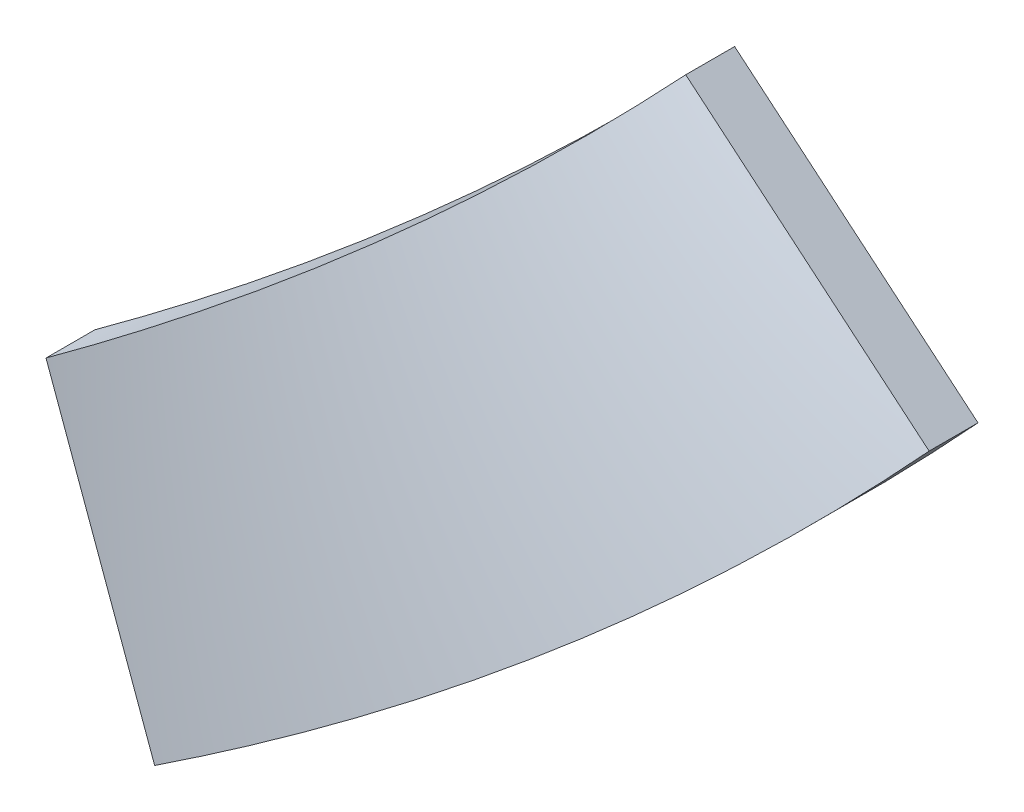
ISO-10303-21;
HEADER;
FILE_DESCRIPTION(('STEP AP214'),'2;1');
FILE_NAME('part.step','',(''),(''),'','','');
FILE_SCHEMA(('AUTOMOTIVE_DESIGN { 1 0 10303 214 1 1 1 1 }'));
ENDSEC;
DATA;
#1=APPLICATION_CONTEXT('core data for automotive mechanical design processes');
#2=APPLICATION_PROTOCOL_DEFINITION('international standard','automotive_design',2000,#1);
#3=PRODUCT_CONTEXT('',#1,'mechanical');
#4=PRODUCT('Part','Part','',(#3));
#5=PRODUCT_RELATED_PRODUCT_CATEGORY('part','',(#4));
#6=PRODUCT_DEFINITION_FORMATION('','',#4);
#7=PRODUCT_DEFINITION_CONTEXT('part definition',#1,'design');
#8=PRODUCT_DEFINITION('design','',#6,#7);
#9=PRODUCT_DEFINITION_SHAPE('','',#8);
#10=(LENGTH_UNIT() NAMED_UNIT(*) SI_UNIT(.MILLI.,.METRE.));
#11=(NAMED_UNIT(*) PLANE_ANGLE_UNIT() SI_UNIT($,.RADIAN.));
#12=(NAMED_UNIT(*) SI_UNIT($,.STERADIAN.) SOLID_ANGLE_UNIT());
#13=UNCERTAINTY_MEASURE_WITH_UNIT(LENGTH_MEASURE(1.E-05),#10,'distance_accuracy_value','');
#14=(GEOMETRIC_REPRESENTATION_CONTEXT(3) GLOBAL_UNCERTAINTY_ASSIGNED_CONTEXT((#13)) GLOBAL_UNIT_ASSIGNED_CONTEXT((#10,
#11,#12)) REPRESENTATION_CONTEXT('',''));
#15=CARTESIAN_POINT('',(0.,0.,0.));
#16=DIRECTION('',(0.,0.,1.));
#17=DIRECTION('',(1.,0.,0.));
#18=AXIS2_PLACEMENT_3D('',#15,#16,#17);
#19=CARTESIAN_POINT('',(9.19253331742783,-7.71345131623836,2.));
#20=CARTESIAN_POINT('',(8.4777767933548,-8.56526497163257,3.41176470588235));
#21=CARTESIAN_POINT('',(7.61867000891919,-9.27123871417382,4.82352941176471));
#22=CARTESIAN_POINT('',(6.75956322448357,-9.97721245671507,6.23529411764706));
#23=CARTESIAN_POINT('',(5.78536203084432,-10.5133051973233,7.64705882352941));
#24=CARTESIAN_POINT('',(4.97439515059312,-10.9595718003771,8.82227234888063));
#25=CARTESIAN_POINT('',(4.10458165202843,-11.2761877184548,10.0002842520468));
#26=CARTESIAN_POINT('',(4.07507070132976,-11.2869298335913,10.0402517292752));
#27=CARTESIAN_POINT('',(4.04555975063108,-11.2976719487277,10.0802192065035));
#28=CARTESIAN_POINT('',(14.1718221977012,-11.8915707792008,2.));
#29=CARTESIAN_POINT('',(13.0699058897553,-13.2047834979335,3.41176470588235));
#30=CARTESIAN_POINT('',(11.7454495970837,-14.2931596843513,4.82352941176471));
#31=CARTESIAN_POINT('',(10.4209933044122,-15.3815358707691,6.23529411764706));
#32=CARTESIAN_POINT('',(8.91909979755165,-16.2080121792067,7.64705882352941));
#33=CARTESIAN_POINT('',(7.66885919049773,-16.8960065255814,8.82227234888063));
#34=CARTESIAN_POINT('',(6.32789671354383,-17.3841227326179,10.0002842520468));
#35=CARTESIAN_POINT('',(6.28240066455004,-17.4006834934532,10.0402517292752));
#36=CARTESIAN_POINT('',(6.23690461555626,-17.4172442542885,10.0802192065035));
#37=(BOUNDED_SURFACE() B_SPLINE_SURFACE(1,2,((#19,#20,#21,#22,#23,#24,#25,#26,#27),(#28,#29,#30,
#31,#32,#33,#34,#35,#36)),.UNSPECIFIED.,.F.,.F.,.F.) B_SPLINE_SURFACE_WITH_KNOTS((2,2),(3,2,2,2,
3),(0.,1.),(0.,0.0294117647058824,0.0588235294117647,0.0833246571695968,0.0841579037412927),
.UNSPECIFIED.) GEOMETRIC_REPRESENTATION_ITEM() RATIONAL_B_SPLINE_SURFACE(((1.,0.995734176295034,
1.,0.995734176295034,1.,0.996446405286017,0.99881337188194,0.99881337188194,0.99881337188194),
(1.,0.995734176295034,1.,0.995734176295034,1.,0.996446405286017,0.99881337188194,
0.99881337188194,0.99881337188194))) REPRESENTATION_ITEM('') SURFACE());
#38=CARTESIAN_POINT('',(9.19253331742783,-7.71345131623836,2.));
#39=CARTESIAN_POINT('',(8.4777767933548,-8.56526497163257,3.41176470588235));
#40=CARTESIAN_POINT('',(7.61867000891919,-9.27123871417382,4.82352941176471));
#41=CARTESIAN_POINT('',(6.75956322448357,-9.97721245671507,6.23529411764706));
#42=CARTESIAN_POINT('',(5.78536203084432,-10.5133051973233,7.64705882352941));
#43=CARTESIAN_POINT('',(4.97439515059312,-10.9595718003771,8.82227234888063));
#44=CARTESIAN_POINT('',(4.10458165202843,-11.2761877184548,10.0002842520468));
#45=CARTESIAN_POINT('',(4.07507070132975,-11.2869298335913,10.0402517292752));
#46=CARTESIAN_POINT('',(4.04555975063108,-11.2976719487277,10.0802192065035));
#47=(BOUNDED_CURVE() B_SPLINE_CURVE(2,(#38,#39,#40,#41,#42,#43,#44,#45,#46),.UNSPECIFIED.,.F.,
.F.) B_SPLINE_CURVE_WITH_KNOTS((3,2,2,2,3),(0.,0.0294117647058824,0.0588235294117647,
0.0833246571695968,0.0841579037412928),
.UNSPECIFIED.) CURVE() GEOMETRIC_REPRESENTATION_ITEM() RATIONAL_B_SPLINE_CURVE((1.,
0.995734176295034,1.,0.995734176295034,1.,0.996446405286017,0.99881337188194,0.99881337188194,0.99881337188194)) REPRESENTATION_ITEM(''));
#48=CARTESIAN_POINT('',(9.19253331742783,-7.71345131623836,2.));
#49=VERTEX_POINT('',#48);
#50=CARTESIAN_POINT('',(4.10452309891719,-11.2762090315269,10.0002842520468));
#51=VERTEX_POINT('',#50);
#52=EDGE_CURVE('E131',#49,#51,#47,.T.);
#53=CARTESIAN_POINT('',(4.10446454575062,-11.276230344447,10.0004428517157));
#54=CARTESIAN_POINT('',(4.29052923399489,-11.7874074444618,10.0004428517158));
#55=CARTESIAN_POINT('',(4.47659392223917,-12.2985845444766,10.0004428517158));
#56=CARTESIAN_POINT('',(4.84872329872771,-13.3209387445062,10.0004428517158));
#57=CARTESIAN_POINT('',(5.03478798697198,-13.8321158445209,10.0004428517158));
#58=CARTESIAN_POINT('',(5.58980717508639,-15.3569247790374,10.0004428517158));
#59=CARTESIAN_POINT('',(5.95876167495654,-16.3705566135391,10.0004428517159));
#60=CARTESIAN_POINT('',(6.32771617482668,-17.3841884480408,10.0004428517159));
#61=B_SPLINE_CURVE_WITH_KNOTS('',3,(#53,#54,#55,#56,#57,#58,#59,#60),.UNSPECIFIED.,.F.,.F.,(4,2,
2,4),(0.,1.63196166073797,3.26392332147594,6.50000000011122),.UNSPECIFIED.);
#62=CARTESIAN_POINT('',(6.32776130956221,-17.3841720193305,10.0003635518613));
#63=VERTEX_POINT('',#62);
#64=EDGE_CURVE('E61',#51,#63,#61,.T.);
#65=CARTESIAN_POINT('',(14.1718221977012,-11.8915707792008,2.));
#66=CARTESIAN_POINT('',(13.0699058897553,-13.2047834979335,3.41176470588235));
#67=CARTESIAN_POINT('',(11.7454495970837,-14.2931596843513,4.82352941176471));
#68=CARTESIAN_POINT('',(10.4209933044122,-15.3815358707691,6.23529411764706));
#69=CARTESIAN_POINT('',(8.91909979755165,-16.2080121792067,7.64705882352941));
#70=CARTESIAN_POINT('',(7.66885919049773,-16.8960065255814,8.82227234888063));
#71=CARTESIAN_POINT('',(6.32789671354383,-17.3841227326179,10.0002842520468));
#72=CARTESIAN_POINT('',(6.28240066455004,-17.4006834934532,10.0402517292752));
#73=CARTESIAN_POINT('',(6.23690461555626,-17.4172442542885,10.0802192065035));
#74=(BOUNDED_CURVE() B_SPLINE_CURVE(2,(#65,#66,#67,#68,#69,#70,#71,#72,#73),.UNSPECIFIED.,.F.,
.F.) B_SPLINE_CURVE_WITH_KNOTS((3,2,2,2,3),(0.,0.0294117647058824,0.0588235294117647,
0.0833246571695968,0.0841579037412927),
.UNSPECIFIED.) CURVE() GEOMETRIC_REPRESENTATION_ITEM() RATIONAL_B_SPLINE_CURVE((1.,
0.995734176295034,1.,0.995734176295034,1.,0.996446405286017,0.99881337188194,0.99881337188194,0.99881337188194)) REPRESENTATION_ITEM(''));
#75=CARTESIAN_POINT('',(14.1718221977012,-11.8915707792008,2.));
#76=VERTEX_POINT('',#75);
#77=EDGE_CURVE('E58',#63,#76,#74,.F.);
#78=DIRECTION('',(-0.766044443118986,0.64278760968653,0.));
#79=VECTOR('',#78,1.);
#80=CARTESIAN_POINT('',(14.1718221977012,-11.8915707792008,2.));
#81=LINE('',#80,#79);
#82=EDGE_CURVE('E59',#49,#76,#81,.F.);
#83=ORIENTED_EDGE('',*,*,#52,.T.);
#84=ORIENTED_EDGE('',*,*,#64,.T.);
#85=ORIENTED_EDGE('',*,*,#77,.T.);
#86=ORIENTED_EDGE('',*,*,#82,.F.);
#87=EDGE_LOOP('',(#83,#84,#85,#86));
#88=FACE_BOUND('',#87,.T.);
#89=ADVANCED_FACE('F17',(#88),#37,.F.);
#90=CARTESIAN_POINT('',(9.19253331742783,-7.71345131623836,1.));
#91=CARTESIAN_POINT('',(8.4777767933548,-8.56526497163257,2.41176470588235));
#92=CARTESIAN_POINT('',(7.61867000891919,-9.27123871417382,3.82352941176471));
#93=CARTESIAN_POINT('',(6.75956322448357,-9.97721245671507,5.23529411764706));
#94=CARTESIAN_POINT('',(5.78536203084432,-10.5133051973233,6.64705882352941));
#95=CARTESIAN_POINT('',(4.97439515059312,-10.9595718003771,7.82227234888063));
#96=CARTESIAN_POINT('',(4.10458165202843,-11.2761877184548,9.00028425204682));
#97=CARTESIAN_POINT('',(4.07507070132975,-11.2869298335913,9.04025172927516));
#98=CARTESIAN_POINT('',(4.04555975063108,-11.2976719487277,9.08021920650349));
#99=CARTESIAN_POINT('',(9.19253331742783,-7.71345131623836,2.));
#100=CARTESIAN_POINT('',(8.4777767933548,-8.56526497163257,3.41176470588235));
#101=CARTESIAN_POINT('',(7.61867000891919,-9.27123871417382,4.82352941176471));
#102=CARTESIAN_POINT('',(6.75956322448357,-9.97721245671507,6.23529411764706));
#103=CARTESIAN_POINT('',(5.78536203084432,-10.5133051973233,7.64705882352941));
#104=CARTESIAN_POINT('',(4.97439515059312,-10.9595718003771,8.82227234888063));
#105=CARTESIAN_POINT('',(4.10458165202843,-11.2761877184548,10.0002842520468));
#106=CARTESIAN_POINT('',(4.07507070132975,-11.2869298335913,10.0402517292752));
#107=CARTESIAN_POINT('',(4.04555975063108,-11.2976719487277,10.0802192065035));
#108=(BOUNDED_SURFACE() B_SPLINE_SURFACE(1,2,((#90,#91,#92,#93,#94,#95,#96,#97,#98),(#99,#100,
#101,#102,#103,#104,#105,#106,#107)),.UNSPECIFIED.,.F.,.F.,.F.) B_SPLINE_SURFACE_WITH_KNOTS((2,
2),(3,2,2,2,3),(0.,1.),(0.,0.0294117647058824,0.0588235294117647,0.0833246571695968,
0.0841579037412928),
.UNSPECIFIED.) GEOMETRIC_REPRESENTATION_ITEM() RATIONAL_B_SPLINE_SURFACE(((1.,0.995734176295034,
1.,0.995734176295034,1.,0.996446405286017,0.99881337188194,0.99881337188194,0.99881337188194),
(1.,0.995734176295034,1.,0.995734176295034,1.,0.996446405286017,0.99881337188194,
0.99881337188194,0.99881337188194))) REPRESENTATION_ITEM('') SURFACE());
#109=CARTESIAN_POINT('',(9.19253331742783,-7.71345131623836,1.));
#110=CARTESIAN_POINT('',(8.4777767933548,-8.56526497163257,2.41176470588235));
#111=CARTESIAN_POINT('',(7.61867000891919,-9.27123871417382,3.82352941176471));
#112=CARTESIAN_POINT('',(6.75956322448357,-9.97721245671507,5.23529411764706));
#113=CARTESIAN_POINT('',(5.78536203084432,-10.5133051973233,6.64705882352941));
#114=CARTESIAN_POINT('',(4.97439515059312,-10.9595718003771,7.82227234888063));
#115=CARTESIAN_POINT('',(4.10458165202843,-11.2761877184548,9.00028425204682));
#116=CARTESIAN_POINT('',(4.07507070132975,-11.2869298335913,9.04025172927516));
#117=CARTESIAN_POINT('',(4.04555975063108,-11.2976719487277,9.08021920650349));
#118=(BOUNDED_CURVE() B_SPLINE_CURVE(2,(#109,#110,#111,#112,#113,#114,#115,#116,#117),
.UNSPECIFIED.,.F.,.F.) B_SPLINE_CURVE_WITH_KNOTS((3,2,2,2,3),(0.,0.0294117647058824,
0.0588235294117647,0.0833246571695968,0.0841579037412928),
.UNSPECIFIED.) CURVE() GEOMETRIC_REPRESENTATION_ITEM() RATIONAL_B_SPLINE_CURVE((1.,
0.995734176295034,1.,0.995734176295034,1.,0.996446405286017,0.99881337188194,0.99881337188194,0.99881337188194)) REPRESENTATION_ITEM(''));
#119=CARTESIAN_POINT('',(9.19253331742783,-7.71345131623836,1.));
#120=VERTEX_POINT('',#119);
#121=CARTESIAN_POINT('',(4.10446454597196,-11.2762303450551,9.00044285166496));
#122=VERTEX_POINT('',#121);
#123=EDGE_CURVE('E70',#120,#122,#118,.T.);
#124=DIRECTION('',(0.,0.,1.));
#125=VECTOR('',#124,1.);
#126=CARTESIAN_POINT('',(4.10446454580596,-11.2762303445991,9.2504428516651));
#127=LINE('',#126,#125);
#128=EDGE_CURVE('E127',#122,#51,#127,.T.);
#129=DIRECTION('',(0.,0.,1.));
#130=VECTOR('',#129,1.);
#131=CARTESIAN_POINT('',(9.19253331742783,-7.71345131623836,1.5));
#132=LINE('',#131,#130);
#133=EDGE_CURVE('E69',#120,#49,#132,.T.);
#134=ORIENTED_EDGE('',*,*,#123,.T.);
#135=ORIENTED_EDGE('',*,*,#128,.T.);
#136=ORIENTED_EDGE('',*,*,#52,.F.);
#137=ORIENTED_EDGE('',*,*,#133,.F.);
#138=EDGE_LOOP('',(#134,#135,#136,#137));
#139=FACE_BOUND('',#138,.T.);
#140=ADVANCED_FACE('F119',(#139),#108,.F.);
#141=CARTESIAN_POINT('',(6.32771617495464,-17.3841884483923,9.2504428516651));
#142=DIRECTION('',(0.939685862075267,0.342038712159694,0.));
#143=DIRECTION('',(-0.342038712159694,0.939685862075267,0.));
#144=AXIS2_PLACEMENT_3D('',#141,#142,#143);
#145=PLANE('',#144);
#146=ORIENTED_EDGE('',*,*,#64,.F.);
#147=ORIENTED_EDGE('',*,*,#128,.F.);
#148=CARTESIAN_POINT('',(4.10446454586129,-11.2762303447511,9.00044285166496));
#149=CARTESIAN_POINT('',(4.29052923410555,-11.7874074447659,9.00044285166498));
#150=CARTESIAN_POINT('',(4.47659392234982,-12.2985845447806,9.000442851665));
#151=CARTESIAN_POINT('',(4.84872329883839,-13.3209387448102,9.00044285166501));
#152=CARTESIAN_POINT('',(5.03478798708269,-13.832115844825,9.000442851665));
#153=CARTESIAN_POINT('',(5.58980717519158,-15.356924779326,9.00044285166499));
#154=CARTESIAN_POINT('',(5.95876167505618,-16.3705566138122,9.00044285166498));
#155=CARTESIAN_POINT('',(6.32771617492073,-17.3841884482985,9.000442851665));
#156=B_SPLINE_CURVE_WITH_KNOTS('',3,(#148,#149,#150,#151,#152,#153,#154,#155),.UNSPECIFIED.,.F.,
.F.,(4,2,2,4),(0.,1.63196166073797,3.26392332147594,6.50000000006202),.UNSPECIFIED.);
#157=CARTESIAN_POINT('',(6.32771617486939,-17.3841884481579,9.00044285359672));
#158=VERTEX_POINT('',#157);
#159=EDGE_CURVE('E80',#122,#158,#156,.T.);
#160=ORIENTED_EDGE('',*,*,#159,.T.);
#161=DIRECTION('',(0.,0.,1.));
#162=VECTOR('',#161,1.);
#163=CARTESIAN_POINT('',(6.32771617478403,-17.3841884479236,9.2504428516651));
#164=LINE('',#163,#162);
#165=EDGE_CURVE('E64',#158,#63,#164,.T.);
#166=ORIENTED_EDGE('',*,*,#165,.T.);
#167=EDGE_LOOP('',(#146,#147,#160,#166));
#168=FACE_BOUND('',#167,.T.);
#169=ADVANCED_FACE('F91',(#168),#145,.F.);
#170=CARTESIAN_POINT('',(14.1718221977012,-11.8915707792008,2.));
#171=CARTESIAN_POINT('',(13.0699058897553,-13.2047834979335,3.41176470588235));
#172=CARTESIAN_POINT('',(11.7454495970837,-14.2931596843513,4.82352941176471));
#173=CARTESIAN_POINT('',(10.4209933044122,-15.3815358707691,6.23529411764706));
#174=CARTESIAN_POINT('',(8.91909979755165,-16.2080121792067,7.64705882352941));
#175=CARTESIAN_POINT('',(7.66877452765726,-16.8960531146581,8.82235193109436));
#176=CARTESIAN_POINT('',(6.32771617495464,-17.3841884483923,10.0004428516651));
#177=CARTESIAN_POINT('',(14.1718221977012,-11.8915707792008,1.));
#178=CARTESIAN_POINT('',(13.0699058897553,-13.2047834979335,2.41176470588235));
#179=CARTESIAN_POINT('',(11.7454495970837,-14.2931596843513,3.82352941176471));
#180=CARTESIAN_POINT('',(10.4209933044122,-15.3815358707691,5.23529411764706));
#181=CARTESIAN_POINT('',(8.91909979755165,-16.2080121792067,6.64705882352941));
#182=CARTESIAN_POINT('',(7.66877452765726,-16.8960531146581,7.82235193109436));
#183=CARTESIAN_POINT('',(6.32771617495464,-17.3841884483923,9.0004428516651));
#184=(BOUNDED_SURFACE() B_SPLINE_SURFACE(1,2,((#170,#171,#172,#173,#174,#175,#176),(#177,#178,
#179,#180,#181,#182,#183)),.UNSPECIFIED.,.F.,.F.,.F.) B_SPLINE_SURFACE_WITH_KNOTS((2,2),(3,2,2,
3),(0.,1.),(0.,0.0294117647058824,0.0588235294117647,0.083326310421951),
.UNSPECIFIED.) GEOMETRIC_REPRESENTATION_ITEM() RATIONAL_B_SPLINE_SURFACE(((1.,0.995734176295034,
1.,0.995734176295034,1.,0.996446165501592,0.998813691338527),(1.,0.995734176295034,1.,
0.995734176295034,1.,0.996446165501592,0.998813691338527))) REPRESENTATION_ITEM('') SURFACE());
#185=CARTESIAN_POINT('',(14.1718221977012,-11.8915707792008,1.));
#186=CARTESIAN_POINT('',(13.0699058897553,-13.2047834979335,2.41176470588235));
#187=CARTESIAN_POINT('',(11.7454495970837,-14.2931596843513,3.82352941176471));
#188=CARTESIAN_POINT('',(10.4209933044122,-15.3815358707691,5.23529411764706));
#189=CARTESIAN_POINT('',(8.91909979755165,-16.2080121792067,6.64705882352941));
#190=CARTESIAN_POINT('',(7.66877452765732,-16.8960531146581,7.82235193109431));
#191=CARTESIAN_POINT('',(6.32771617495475,-17.3841884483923,9.000442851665));
#192=(BOUNDED_CURVE() B_SPLINE_CURVE(2,(#185,#186,#187,#188,#189,#190,#191),.UNSPECIFIED.,.F.,
.F.) B_SPLINE_CURVE_WITH_KNOTS((3,2,2,3),(0.,0.0294117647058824,0.0588235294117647,
0.0833263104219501),
.UNSPECIFIED.) CURVE() GEOMETRIC_REPRESENTATION_ITEM() RATIONAL_B_SPLINE_CURVE((1.,
0.995734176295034,1.,0.995734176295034,1.,0.996446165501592,0.998813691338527)) REPRESENTATION_ITEM(''));
#193=CARTESIAN_POINT('',(14.1718221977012,-11.8915707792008,1.));
#194=VERTEX_POINT('',#193);
#195=EDGE_CURVE('E29',#158,#194,#192,.F.);
#196=DIRECTION('',(0.,0.,1.));
#197=VECTOR('',#196,1.);
#198=CARTESIAN_POINT('',(14.1718221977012,-11.8915707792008,1.5));
#199=LINE('',#198,#197);
#200=EDGE_CURVE('E37',#76,#194,#199,.F.);
#201=ORIENTED_EDGE('',*,*,#77,.F.);
#202=ORIENTED_EDGE('',*,*,#165,.F.);
#203=ORIENTED_EDGE('',*,*,#195,.T.);
#204=ORIENTED_EDGE('',*,*,#200,.F.);
#205=EDGE_LOOP('',(#201,#202,#203,#204));
#206=FACE_BOUND('',#205,.T.);
#207=ADVANCED_FACE('F73',(#206),#184,.F.);
#208=CARTESIAN_POINT('',(14.1718221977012,-11.8915707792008,1.5));
#209=DIRECTION('',(0.64278760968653,0.766044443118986,0.));
#210=DIRECTION('',(-0.766044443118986,0.64278760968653,0.));
#211=AXIS2_PLACEMENT_3D('',#208,#209,#210);
#212=PLANE('',#211);
#213=ORIENTED_EDGE('',*,*,#133,.T.);
#214=ORIENTED_EDGE('',*,*,#82,.T.);
#215=ORIENTED_EDGE('',*,*,#200,.T.);
#216=DIRECTION('',(-0.766044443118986,0.64278760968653,0.));
#217=VECTOR('',#216,1.);
#218=CARTESIAN_POINT('',(11.6821777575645,-9.80251104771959,1.));
#219=LINE('',#218,#217);
#220=EDGE_CURVE('E11',#194,#120,#219,.T.);
#221=ORIENTED_EDGE('',*,*,#220,.T.);
#222=EDGE_LOOP('',(#213,#214,#215,#221));
#223=FACE_BOUND('',#222,.T.);
#224=ADVANCED_FACE('F67',(#223),#212,.T.);
#225=CARTESIAN_POINT('',(14.1718221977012,-11.8915707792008,1.));
#226=CARTESIAN_POINT('',(13.0699058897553,-13.2047834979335,2.41176470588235));
#227=CARTESIAN_POINT('',(11.7454495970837,-14.2931596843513,3.82352941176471));
#228=CARTESIAN_POINT('',(10.4209933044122,-15.3815358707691,5.23529411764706));
#229=CARTESIAN_POINT('',(8.91909979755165,-16.2080121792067,6.64705882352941));
#230=CARTESIAN_POINT('',(7.66877452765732,-16.8960531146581,7.82235193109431));
#231=CARTESIAN_POINT('',(6.32771617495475,-17.3841884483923,9.000442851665));
#232=CARTESIAN_POINT('',(9.19253331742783,-7.71345131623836,1.));
#233=CARTESIAN_POINT('',(8.4777767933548,-8.56526497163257,2.41176470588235));
#234=CARTESIAN_POINT('',(7.61867000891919,-9.27123871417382,3.82352941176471));
#235=CARTESIAN_POINT('',(6.75956322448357,-9.97721245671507,5.23529411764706));
#236=CARTESIAN_POINT('',(5.78536203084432,-10.5133051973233,6.64705882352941));
#237=CARTESIAN_POINT('',(4.9743402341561,-10.9596020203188,7.82235193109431));
#238=CARTESIAN_POINT('',(4.10446454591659,-11.2762303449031,9.000442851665));
#239=(BOUNDED_SURFACE() B_SPLINE_SURFACE(1,2,((#225,#226,#227,#228,#229,#230,#231),(#232,#233,
#234,#235,#236,#237,#238)),.UNSPECIFIED.,.F.,.F.,.F.) B_SPLINE_SURFACE_WITH_KNOTS((2,2),(3,2,2,
3),(0.,1.),(0.,0.0294117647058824,0.0588235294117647,0.0833263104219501),
.UNSPECIFIED.) GEOMETRIC_REPRESENTATION_ITEM() RATIONAL_B_SPLINE_SURFACE(((1.,0.995734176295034,
1.,0.995734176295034,1.,0.996446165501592,0.998813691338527),(1.,0.995734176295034,1.,
0.995734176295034,1.,0.996446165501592,0.998813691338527))) REPRESENTATION_ITEM('') SURFACE());
#240=ORIENTED_EDGE('',*,*,#195,.F.);
#241=ORIENTED_EDGE('',*,*,#159,.F.);
#242=ORIENTED_EDGE('',*,*,#123,.F.);
#243=ORIENTED_EDGE('',*,*,#220,.F.);
#244=EDGE_LOOP('',(#240,#241,#242,#243));
#245=FACE_BOUND('',#244,.T.);
#246=ADVANCED_FACE('F94',(#245),#239,.F.);
#247=CLOSED_SHELL('',(#89,#140,#169,#207,#224,#246));
#248=MANIFOLD_SOLID_BREP('B1',#247);
#249=ADVANCED_BREP_SHAPE_REPRESENTATION('',(#18,#248),#14);
#250=SHAPE_DEFINITION_REPRESENTATION(#9,#249);
ENDSEC;
END-ISO-10303-21;
